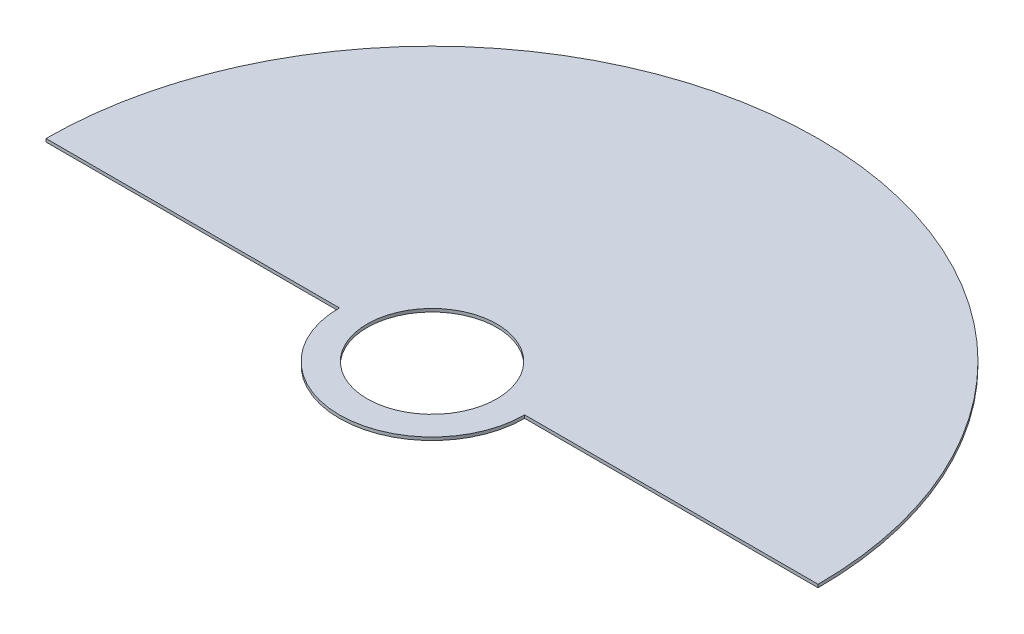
ISO-10303-21;
HEADER;
FILE_DESCRIPTION(('STEP AP214'),'2;1');
FILE_NAME('part.step','',(''),(''),'','','');
FILE_SCHEMA(('AUTOMOTIVE_DESIGN { 1 0 10303 214 1 1 1 1 }'));
ENDSEC;
DATA;
#1=APPLICATION_CONTEXT('core data for automotive mechanical design processes');
#2=APPLICATION_PROTOCOL_DEFINITION('international standard','automotive_design',2000,#1);
#3=PRODUCT_CONTEXT('',#1,'mechanical');
#4=PRODUCT('Part','Part','',(#3));
#5=PRODUCT_RELATED_PRODUCT_CATEGORY('part','',(#4));
#6=PRODUCT_DEFINITION_FORMATION('','',#4);
#7=PRODUCT_DEFINITION_CONTEXT('part definition',#1,'design');
#8=PRODUCT_DEFINITION('design','',#6,#7);
#9=PRODUCT_DEFINITION_SHAPE('','',#8);
#10=(LENGTH_UNIT() NAMED_UNIT(*) SI_UNIT(.MILLI.,.METRE.));
#11=(NAMED_UNIT(*) PLANE_ANGLE_UNIT() SI_UNIT($,.RADIAN.));
#12=(NAMED_UNIT(*) SI_UNIT($,.STERADIAN.) SOLID_ANGLE_UNIT());
#13=UNCERTAINTY_MEASURE_WITH_UNIT(LENGTH_MEASURE(1.E-05),#10,'distance_accuracy_value','');
#14=(GEOMETRIC_REPRESENTATION_CONTEXT(3) GLOBAL_UNCERTAINTY_ASSIGNED_CONTEXT((#13)) GLOBAL_UNIT_ASSIGNED_CONTEXT((#10,
#11,#12)) REPRESENTATION_CONTEXT('',''));
#15=CARTESIAN_POINT('',(0.,0.,0.));
#16=DIRECTION('',(0.,0.,1.));
#17=DIRECTION('',(1.,0.,0.));
#18=AXIS2_PLACEMENT_3D('',#15,#16,#17);
#19=CARTESIAN_POINT('',(0.,-1.,0.));
#20=DIRECTION('',(0.,1.,0.));
#21=DIRECTION('',(0.,0.,1.));
#22=AXIS2_PLACEMENT_3D('',#19,#20,#21);
#23=CYLINDRICAL_SURFACE('',#22,30.);
#24=CARTESIAN_POINT('',(0.,0.,0.));
#25=DIRECTION('',(0.,1.,0.));
#26=DIRECTION('',(0.,0.,1.));
#27=AXIS2_PLACEMENT_3D('',#24,#25,#26);
#28=CIRCLE('',#27,30.);
#29=CARTESIAN_POINT('',(-30.,0.,0.));
#30=VERTEX_POINT('',#29);
#31=CARTESIAN_POINT('',(30.,0.,0.));
#32=VERTEX_POINT('',#31);
#33=EDGE_CURVE('E104',#30,#32,#28,.T.);
#34=ORIENTED_EDGE('',*,*,#33,.F.);
#35=DIRECTION('',(0.,1.,0.));
#36=VECTOR('',#35,1.);
#37=CARTESIAN_POINT('',(-30.,-1.,0.));
#38=LINE('',#37,#36);
#39=CARTESIAN_POINT('',(-30.,-1.,0.));
#40=VERTEX_POINT('',#39);
#41=EDGE_CURVE('E11',#40,#30,#38,.T.);
#42=ORIENTED_EDGE('',*,*,#41,.F.);
#43=CARTESIAN_POINT('',(0.,-1.,0.));
#44=DIRECTION('',(0.,1.,0.));
#45=DIRECTION('',(0.,0.,1.));
#46=AXIS2_PLACEMENT_3D('',#43,#44,#45);
#47=CIRCLE('',#46,30.);
#48=CARTESIAN_POINT('',(30.,-1.,0.));
#49=VERTEX_POINT('',#48);
#50=EDGE_CURVE('E97',#40,#49,#47,.T.);
#51=ORIENTED_EDGE('',*,*,#50,.T.);
#52=DIRECTION('',(0.,1.,0.));
#53=VECTOR('',#52,1.);
#54=CARTESIAN_POINT('',(30.,-1.,0.));
#55=LINE('',#54,#53);
#56=EDGE_CURVE('E42',#49,#32,#55,.T.);
#57=ORIENTED_EDGE('',*,*,#56,.T.);
#58=EDGE_LOOP('',(#34,#42,#51,#57));
#59=FACE_BOUND('',#58,.T.);
#60=ADVANCED_FACE('F38',(#59),#23,.T.);
#61=CARTESIAN_POINT('',(-125.,-1.,0.));
#62=DIRECTION('',(0.,0.,1.));
#63=DIRECTION('',(1.,0.,0.));
#64=AXIS2_PLACEMENT_3D('',#61,#62,#63);
#65=PLANE('',#64);
#66=DIRECTION('',(1.,0.,0.));
#67=VECTOR('',#66,1.);
#68=CARTESIAN_POINT('',(-125.,0.,0.));
#69=LINE('',#68,#67);
#70=CARTESIAN_POINT('',(-125.,0.,0.));
#71=VERTEX_POINT('',#70);
#72=EDGE_CURVE('E99',#71,#30,#69,.T.);
#73=ORIENTED_EDGE('',*,*,#72,.F.);
#74=DIRECTION('',(0.,1.,0.));
#75=VECTOR('',#74,1.);
#76=CARTESIAN_POINT('',(-125.,-1.,0.));
#77=LINE('',#76,#75);
#78=CARTESIAN_POINT('',(-125.,-1.,0.));
#79=VERTEX_POINT('',#78);
#80=EDGE_CURVE('E48',#79,#71,#77,.T.);
#81=ORIENTED_EDGE('',*,*,#80,.F.);
#82=DIRECTION('',(1.,0.,0.));
#83=VECTOR('',#82,1.);
#84=CARTESIAN_POINT('',(-125.,-1.,0.));
#85=LINE('',#84,#83);
#86=EDGE_CURVE('E94',#79,#40,#85,.T.);
#87=ORIENTED_EDGE('',*,*,#86,.T.);
#88=ORIENTED_EDGE('',*,*,#41,.T.);
#89=EDGE_LOOP('',(#73,#81,#87,#88));
#90=FACE_BOUND('',#89,.T.);
#91=ADVANCED_FACE('F114',(#90),#65,.T.);
#92=CARTESIAN_POINT('',(0.,-1.,0.));
#93=DIRECTION('',(0.,1.,0.));
#94=DIRECTION('',(0.,0.,1.));
#95=AXIS2_PLACEMENT_3D('',#92,#93,#94);
#96=CYLINDRICAL_SURFACE('',#95,125.);
#97=CARTESIAN_POINT('',(0.,0.,0.));
#98=DIRECTION('',(0.,1.,0.));
#99=DIRECTION('',(0.,0.,1.));
#100=AXIS2_PLACEMENT_3D('',#97,#98,#99);
#101=CIRCLE('',#100,125.);
#102=CARTESIAN_POINT('',(125.,0.,0.));
#103=VERTEX_POINT('',#102);
#104=EDGE_CURVE('E89',#103,#71,#101,.T.);
#105=ORIENTED_EDGE('',*,*,#104,.F.);
#106=DIRECTION('',(0.,1.,0.));
#107=VECTOR('',#106,1.);
#108=CARTESIAN_POINT('',(125.,-1.,0.));
#109=LINE('',#108,#107);
#110=CARTESIAN_POINT('',(125.,-1.,0.));
#111=VERTEX_POINT('',#110);
#112=EDGE_CURVE('E84',#111,#103,#109,.T.);
#113=ORIENTED_EDGE('',*,*,#112,.F.);
#114=CARTESIAN_POINT('',(0.,-1.,0.));
#115=DIRECTION('',(0.,1.,0.));
#116=DIRECTION('',(0.,0.,1.));
#117=AXIS2_PLACEMENT_3D('',#114,#115,#116);
#118=CIRCLE('',#117,125.);
#119=EDGE_CURVE('E87',#111,#79,#118,.T.);
#120=ORIENTED_EDGE('',*,*,#119,.T.);
#121=ORIENTED_EDGE('',*,*,#80,.T.);
#122=EDGE_LOOP('',(#105,#113,#120,#121));
#123=FACE_BOUND('',#122,.T.);
#124=ADVANCED_FACE('F86',(#123),#96,.T.);
#125=CARTESIAN_POINT('',(30.,-1.,0.));
#126=DIRECTION('',(0.,0.,1.));
#127=DIRECTION('',(1.,0.,0.));
#128=AXIS2_PLACEMENT_3D('',#125,#126,#127);
#129=PLANE('',#128);
#130=DIRECTION('',(1.,0.,0.));
#131=VECTOR('',#130,1.);
#132=CARTESIAN_POINT('',(30.,0.,0.));
#133=LINE('',#132,#131);
#134=EDGE_CURVE('E107',#32,#103,#133,.T.);
#135=ORIENTED_EDGE('',*,*,#134,.F.);
#136=ORIENTED_EDGE('',*,*,#56,.F.);
#137=DIRECTION('',(1.,0.,0.));
#138=VECTOR('',#137,1.);
#139=CARTESIAN_POINT('',(30.,-1.,0.));
#140=LINE('',#139,#138);
#141=EDGE_CURVE('E93',#49,#111,#140,.T.);
#142=ORIENTED_EDGE('',*,*,#141,.T.);
#143=ORIENTED_EDGE('',*,*,#112,.T.);
#144=EDGE_LOOP('',(#135,#136,#142,#143));
#145=FACE_BOUND('',#144,.T.);
#146=ADVANCED_FACE('F96',(#145),#129,.T.);
#147=CARTESIAN_POINT('',(0.,-1.,0.));
#148=DIRECTION('',(0.,1.,0.));
#149=DIRECTION('',(0.,0.,1.));
#150=AXIS2_PLACEMENT_3D('',#147,#148,#149);
#151=PLANE('',#150);
#152=CARTESIAN_POINT('',(0.,-1.,0.));
#153=DIRECTION('',(0.,1.,0.));
#154=DIRECTION('',(0.,0.,1.));
#155=AXIS2_PLACEMENT_3D('',#152,#153,#154);
#156=CIRCLE('',#155,21.);
#157=CARTESIAN_POINT('',(0.,-1.,21.));
#158=VERTEX_POINT('',#157);
#159=EDGE_CURVE('E108',#158,#158,#156,.T.);
#160=ORIENTED_EDGE('',*,*,#159,.T.);
#161=EDGE_LOOP('',(#160));
#162=FACE_BOUND('',#161,.T.);
#163=ORIENTED_EDGE('',*,*,#50,.F.);
#164=ORIENTED_EDGE('',*,*,#86,.F.);
#165=ORIENTED_EDGE('',*,*,#119,.F.);
#166=ORIENTED_EDGE('',*,*,#141,.F.);
#167=EDGE_LOOP('',(#163,#164,#165,#166));
#168=FACE_BOUND('',#167,.T.);
#169=ADVANCED_FACE('F92',(#162,#168),#151,.F.);
#170=CARTESIAN_POINT('',(0.,0.,0.));
#171=DIRECTION('',(0.,1.,0.));
#172=DIRECTION('',(0.,0.,1.));
#173=AXIS2_PLACEMENT_3D('',#170,#171,#172);
#174=PLANE('',#173);
#175=CARTESIAN_POINT('',(0.,0.,0.));
#176=DIRECTION('',(0.,1.,0.));
#177=DIRECTION('',(0.,0.,1.));
#178=AXIS2_PLACEMENT_3D('',#175,#176,#177);
#179=CIRCLE('',#178,21.);
#180=CARTESIAN_POINT('',(0.,0.,21.));
#181=VERTEX_POINT('',#180);
#182=EDGE_CURVE('E138',#181,#181,#179,.T.);
#183=ORIENTED_EDGE('',*,*,#182,.F.);
#184=EDGE_LOOP('',(#183));
#185=FACE_BOUND('',#184,.T.);
#186=ORIENTED_EDGE('',*,*,#33,.T.);
#187=ORIENTED_EDGE('',*,*,#134,.T.);
#188=ORIENTED_EDGE('',*,*,#104,.T.);
#189=ORIENTED_EDGE('',*,*,#72,.T.);
#190=EDGE_LOOP('',(#186,#187,#188,#189));
#191=FACE_BOUND('',#190,.T.);
#192=ADVANCED_FACE('F40',(#185,#191),#174,.T.);
#193=CARTESIAN_POINT('',(0.,-1.,0.));
#194=DIRECTION('',(0.,1.,0.));
#195=DIRECTION('',(0.,0.,1.));
#196=AXIS2_PLACEMENT_3D('',#193,#194,#195);
#197=CYLINDRICAL_SURFACE('',#196,21.);
#198=ORIENTED_EDGE('',*,*,#159,.F.);
#199=EDGE_LOOP('',(#198));
#200=FACE_BOUND('',#199,.T.);
#201=ORIENTED_EDGE('',*,*,#182,.T.);
#202=EDGE_LOOP('',(#201));
#203=FACE_BOUND('',#202,.T.);
#204=ADVANCED_FACE('F133',(#200,#203),#197,.F.);
#205=CLOSED_SHELL('',(#60,#91,#124,#146,#169,#192,#204));
#206=MANIFOLD_SOLID_BREP('B2',#205);
#207=ADVANCED_BREP_SHAPE_REPRESENTATION('',(#18,#206),#14);
#208=SHAPE_DEFINITION_REPRESENTATION(#9,#207);
ENDSEC;
END-ISO-10303-21;
